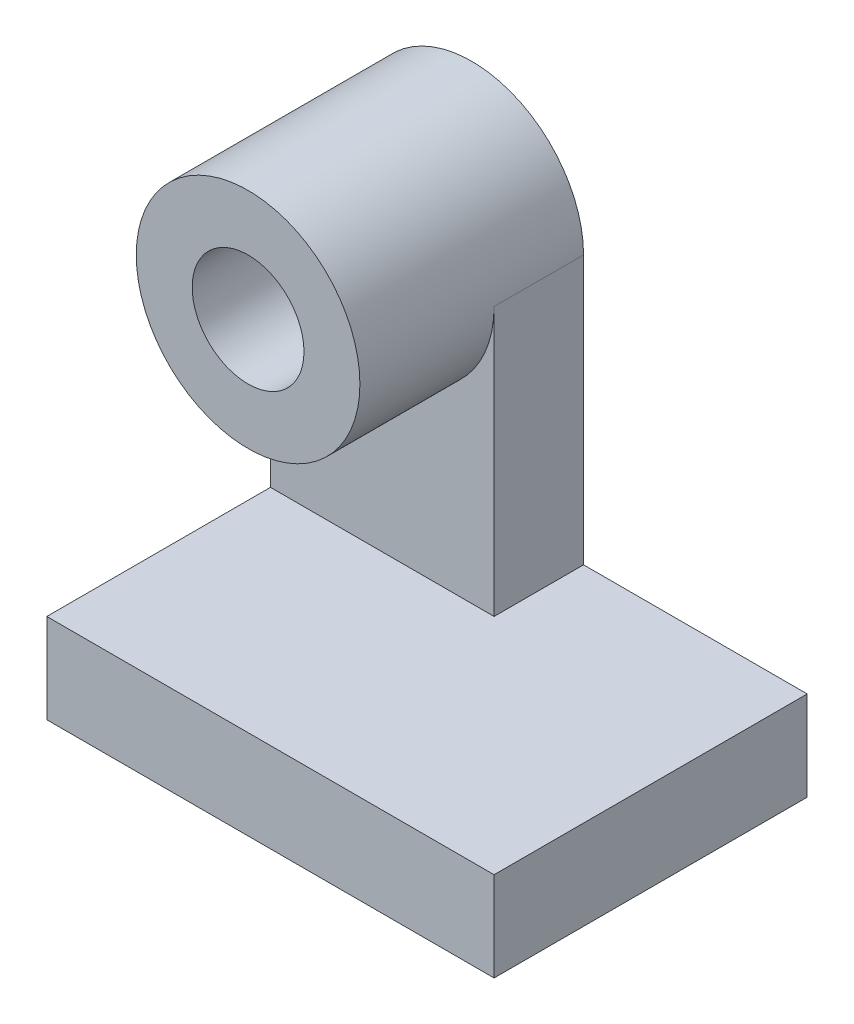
ISO-10303-21;
HEADER;
FILE_DESCRIPTION(('STEP AP214'),'2;1');
FILE_NAME('part.step','',(''),(''),'','','');
FILE_SCHEMA(('AUTOMOTIVE_DESIGN { 1 0 10303 214 1 1 1 1 }'));
ENDSEC;
DATA;
#1=APPLICATION_CONTEXT('core data for automotive mechanical design processes');
#2=APPLICATION_PROTOCOL_DEFINITION('international standard','automotive_design',2000,#1);
#3=PRODUCT_CONTEXT('',#1,'mechanical');
#4=PRODUCT('Part','Part','',(#3));
#5=PRODUCT_RELATED_PRODUCT_CATEGORY('part','',(#4));
#6=PRODUCT_DEFINITION_FORMATION('','',#4);
#7=PRODUCT_DEFINITION_CONTEXT('part definition',#1,'design');
#8=PRODUCT_DEFINITION('design','',#6,#7);
#9=PRODUCT_DEFINITION_SHAPE('','',#8);
#10=(LENGTH_UNIT() NAMED_UNIT(*) SI_UNIT(.MILLI.,.METRE.));
#11=(NAMED_UNIT(*) PLANE_ANGLE_UNIT() SI_UNIT($,.RADIAN.));
#12=(NAMED_UNIT(*) SI_UNIT($,.STERADIAN.) SOLID_ANGLE_UNIT());
#13=UNCERTAINTY_MEASURE_WITH_UNIT(LENGTH_MEASURE(1.E-05),#10,'distance_accuracy_value','');
#14=(GEOMETRIC_REPRESENTATION_CONTEXT(3) GLOBAL_UNCERTAINTY_ASSIGNED_CONTEXT((#13)) GLOBAL_UNIT_ASSIGNED_CONTEXT((#10,
#11,#12)) REPRESENTATION_CONTEXT('',''));
#15=CARTESIAN_POINT('',(0.,0.,0.));
#16=DIRECTION('',(0.,0.,1.));
#17=DIRECTION('',(1.,0.,0.));
#18=AXIS2_PLACEMENT_3D('',#15,#16,#17);
#19=CARTESIAN_POINT('',(0.,0.,88.9));
#20=DIRECTION('',(-1.,0.,0.));
#21=DIRECTION('',(0.,0.,1.));
#22=AXIS2_PLACEMENT_3D('',#19,#20,#21);
#23=PLANE('',#22);
#24=DIRECTION('',(0.,1.,0.));
#25=VECTOR('',#24,1.);
#26=CARTESIAN_POINT('',(0.,0.,0.));
#27=LINE('',#26,#25);
#28=CARTESIAN_POINT('',(0.,0.,0.));
#29=VERTEX_POINT('',#28);
#30=CARTESIAN_POINT('',(0.,101.6,0.));
#31=VERTEX_POINT('',#30);
#32=EDGE_CURVE('E150',#29,#31,#27,.T.);
#33=ORIENTED_EDGE('',*,*,#32,.F.);
#34=DIRECTION('',(0.,0.,-1.));
#35=VECTOR('',#34,1.);
#36=CARTESIAN_POINT('',(0.,0.,88.9));
#37=LINE('',#36,#35);
#38=CARTESIAN_POINT('',(0.,0.,88.9));
#39=VERTEX_POINT('',#38);
#40=EDGE_CURVE('E11',#39,#29,#37,.T.);
#41=ORIENTED_EDGE('',*,*,#40,.F.);
#42=DIRECTION('',(0.,1.,0.));
#43=VECTOR('',#42,1.);
#44=CARTESIAN_POINT('',(0.,0.,88.9));
#45=LINE('',#44,#43);
#46=CARTESIAN_POINT('',(0.,25.4,88.9));
#47=VERTEX_POINT('',#46);
#48=EDGE_CURVE('E145',#39,#47,#45,.T.);
#49=ORIENTED_EDGE('',*,*,#48,.T.);
#50=DIRECTION('',(0.,0.,-1.));
#51=VECTOR('',#50,1.);
#52=CARTESIAN_POINT('',(0.,25.4,88.9));
#53=LINE('',#52,#51);
#54=CARTESIAN_POINT('',(0.,25.4,25.4));
#55=VERTEX_POINT('',#54);
#56=EDGE_CURVE('E132',#47,#55,#53,.T.);
#57=ORIENTED_EDGE('',*,*,#56,.T.);
#58=DIRECTION('',(0.,1.,0.));
#59=VECTOR('',#58,1.);
#60=CARTESIAN_POINT('',(0.,0.,25.4));
#61=LINE('',#60,#59);
#62=CARTESIAN_POINT('',(0.,101.6,25.4));
#63=VERTEX_POINT('',#62);
#64=EDGE_CURVE('E114',#55,#63,#61,.T.);
#65=ORIENTED_EDGE('',*,*,#64,.T.);
#66=DIRECTION('',(0.,0.,-1.));
#67=VECTOR('',#66,1.);
#68=CARTESIAN_POINT('',(0.,101.6,25.4));
#69=LINE('',#68,#67);
#70=EDGE_CURVE('E113',#63,#31,#69,.T.);
#71=ORIENTED_EDGE('',*,*,#70,.T.);
#72=EDGE_LOOP('',(#33,#41,#49,#57,#65,#71));
#73=FACE_BOUND('',#72,.T.);
#74=ADVANCED_FACE('F34',(#73),#23,.T.);
#75=CARTESIAN_POINT('',(0.,0.,88.9));
#76=DIRECTION('',(0.,1.,0.));
#77=DIRECTION('',(0.,0.,1.));
#78=AXIS2_PLACEMENT_3D('',#75,#76,#77);
#79=PLANE('',#78);
#80=DIRECTION('',(1.,0.,0.));
#81=VECTOR('',#80,1.);
#82=CARTESIAN_POINT('',(0.,0.,0.));
#83=LINE('',#82,#81);
#84=CARTESIAN_POINT('',(127.,0.,0.));
#85=VERTEX_POINT('',#84);
#86=EDGE_CURVE('E143',#29,#85,#83,.T.);
#87=ORIENTED_EDGE('',*,*,#86,.T.);
#88=DIRECTION('',(0.,0.,-1.));
#89=VECTOR('',#88,1.);
#90=CARTESIAN_POINT('',(127.,0.,88.9));
#91=LINE('',#90,#89);
#92=CARTESIAN_POINT('',(127.,0.,88.9));
#93=VERTEX_POINT('',#92);
#94=EDGE_CURVE('E42',#93,#85,#91,.T.);
#95=ORIENTED_EDGE('',*,*,#94,.F.);
#96=DIRECTION('',(1.,0.,0.));
#97=VECTOR('',#96,1.);
#98=CARTESIAN_POINT('',(0.,0.,88.9));
#99=LINE('',#98,#97);
#100=EDGE_CURVE('E136',#39,#93,#99,.T.);
#101=ORIENTED_EDGE('',*,*,#100,.F.);
#102=ORIENTED_EDGE('',*,*,#40,.T.);
#103=EDGE_LOOP('',(#87,#95,#101,#102));
#104=FACE_BOUND('',#103,.T.);
#105=ADVANCED_FACE('F199',(#104),#79,.F.);
#106=CARTESIAN_POINT('',(127.,0.,88.9));
#107=DIRECTION('',(-1.,0.,0.));
#108=DIRECTION('',(0.,0.,1.));
#109=AXIS2_PLACEMENT_3D('',#106,#107,#108);
#110=PLANE('',#109);
#111=DIRECTION('',(0.,1.,0.));
#112=VECTOR('',#111,1.);
#113=CARTESIAN_POINT('',(127.,0.,0.));
#114=LINE('',#113,#112);
#115=CARTESIAN_POINT('',(127.,25.4,0.));
#116=VERTEX_POINT('',#115);
#117=EDGE_CURVE('E146',#85,#116,#114,.T.);
#118=ORIENTED_EDGE('',*,*,#117,.T.);
#119=DIRECTION('',(0.,0.,-1.));
#120=VECTOR('',#119,1.);
#121=CARTESIAN_POINT('',(127.,25.4,88.9));
#122=LINE('',#121,#120);
#123=CARTESIAN_POINT('',(127.,25.4,88.9));
#124=VERTEX_POINT('',#123);
#125=EDGE_CURVE('E135',#124,#116,#122,.T.);
#126=ORIENTED_EDGE('',*,*,#125,.F.);
#127=DIRECTION('',(0.,1.,0.));
#128=VECTOR('',#127,1.);
#129=CARTESIAN_POINT('',(127.,0.,88.9));
#130=LINE('',#129,#128);
#131=EDGE_CURVE('E153',#93,#124,#130,.T.);
#132=ORIENTED_EDGE('',*,*,#131,.F.);
#133=ORIENTED_EDGE('',*,*,#94,.T.);
#134=EDGE_LOOP('',(#118,#126,#132,#133));
#135=FACE_BOUND('',#134,.T.);
#136=ADVANCED_FACE('F171',(#135),#110,.F.);
#137=CARTESIAN_POINT('',(0.,25.4,88.9));
#138=DIRECTION('',(0.,1.,0.));
#139=DIRECTION('',(0.,0.,1.));
#140=AXIS2_PLACEMENT_3D('',#137,#138,#139);
#141=PLANE('',#140);
#142=DIRECTION('',(0.,0.,-1.));
#143=VECTOR('',#142,1.);
#144=CARTESIAN_POINT('',(63.5,25.4,25.4));
#145=LINE('',#144,#143);
#146=CARTESIAN_POINT('',(63.5,25.4,25.4));
#147=VERTEX_POINT('',#146);
#148=CARTESIAN_POINT('',(63.5,25.4,0.));
#149=VERTEX_POINT('',#148);
#150=EDGE_CURVE('E102',#147,#149,#145,.T.);
#151=ORIENTED_EDGE('',*,*,#150,.F.);
#152=DIRECTION('',(1.,0.,0.));
#153=VECTOR('',#152,1.);
#154=CARTESIAN_POINT('',(0.,25.4,25.4));
#155=LINE('',#154,#153);
#156=EDGE_CURVE('E50',#55,#147,#155,.T.);
#157=ORIENTED_EDGE('',*,*,#156,.F.);
#158=ORIENTED_EDGE('',*,*,#56,.F.);
#159=DIRECTION('',(1.,0.,0.));
#160=VECTOR('',#159,1.);
#161=CARTESIAN_POINT('',(0.,25.4,88.9));
#162=LINE('',#161,#160);
#163=EDGE_CURVE('E155',#47,#124,#162,.T.);
#164=ORIENTED_EDGE('',*,*,#163,.T.);
#165=ORIENTED_EDGE('',*,*,#125,.T.);
#166=DIRECTION('',(1.,0.,0.));
#167=VECTOR('',#166,1.);
#168=CARTESIAN_POINT('',(0.,25.4,0.));
#169=LINE('',#168,#167);
#170=EDGE_CURVE('E56',#149,#116,#169,.T.);
#171=ORIENTED_EDGE('',*,*,#170,.F.);
#172=EDGE_LOOP('',(#151,#157,#158,#164,#165,#171));
#173=FACE_BOUND('',#172,.T.);
#174=ADVANCED_FACE('F168',(#173),#141,.T.);
#175=CARTESIAN_POINT('',(0.,0.,88.9));
#176=DIRECTION('',(0.,0.,-1.));
#177=DIRECTION('',(-1.,0.,0.));
#178=AXIS2_PLACEMENT_3D('',#175,#176,#177);
#179=PLANE('',#178);
#180=ORIENTED_EDGE('',*,*,#48,.F.);
#181=ORIENTED_EDGE('',*,*,#100,.T.);
#182=ORIENTED_EDGE('',*,*,#131,.T.);
#183=ORIENTED_EDGE('',*,*,#163,.F.);
#184=EDGE_LOOP('',(#180,#181,#182,#183));
#185=FACE_BOUND('',#184,.T.);
#186=ADVANCED_FACE('F164',(#185),#179,.F.);
#187=CARTESIAN_POINT('',(0.,0.,0.));
#188=DIRECTION('',(0.,0.,-1.));
#189=DIRECTION('',(-1.,0.,0.));
#190=AXIS2_PLACEMENT_3D('',#187,#188,#189);
#191=PLANE('',#190);
#192=ORIENTED_EDGE('',*,*,#32,.T.);
#193=CARTESIAN_POINT('',(31.75,101.6,0.));
#194=DIRECTION('',(0.,0.,1.));
#195=DIRECTION('',(1.,0.,0.));
#196=AXIS2_PLACEMENT_3D('',#193,#194,#195);
#197=CIRCLE('',#196,31.75);
#198=CARTESIAN_POINT('',(63.5,101.6,0.));
#199=VERTEX_POINT('',#198);
#200=EDGE_CURVE('E176',#199,#31,#197,.T.);
#201=ORIENTED_EDGE('',*,*,#200,.F.);
#202=DIRECTION('',(0.,1.,0.));
#203=VECTOR('',#202,1.);
#204=CARTESIAN_POINT('',(63.5,0.,0.));
#205=LINE('',#204,#203);
#206=EDGE_CURVE('E97',#149,#199,#205,.T.);
#207=ORIENTED_EDGE('',*,*,#206,.F.);
#208=ORIENTED_EDGE('',*,*,#170,.T.);
#209=ORIENTED_EDGE('',*,*,#117,.F.);
#210=ORIENTED_EDGE('',*,*,#86,.F.);
#211=EDGE_LOOP('',(#192,#201,#207,#208,#209,#210));
#212=FACE_BOUND('',#211,.T.);
#213=CARTESIAN_POINT('',(31.75,101.6,0.));
#214=DIRECTION('',(0.,0.,1.));
#215=DIRECTION('',(1.,0.,0.));
#216=AXIS2_PLACEMENT_3D('',#213,#214,#215);
#217=CIRCLE('',#216,15.875);
#218=CARTESIAN_POINT('',(47.625,101.6,0.));
#219=VERTEX_POINT('',#218);
#220=EDGE_CURVE('E119',#219,#219,#217,.T.);
#221=ORIENTED_EDGE('',*,*,#220,.T.);
#222=EDGE_LOOP('',(#221));
#223=FACE_BOUND('',#222,.T.);
#224=ADVANCED_FACE('F174',(#212,#223),#191,.T.);
#225=CARTESIAN_POINT('',(63.5,0.,25.4));
#226=DIRECTION('',(-1.,0.,0.));
#227=DIRECTION('',(0.,0.,1.));
#228=AXIS2_PLACEMENT_3D('',#225,#226,#227);
#229=PLANE('',#228);
#230=ORIENTED_EDGE('',*,*,#206,.T.);
#231=DIRECTION('',(0.,0.,-1.));
#232=VECTOR('',#231,1.);
#233=CARTESIAN_POINT('',(63.5,101.6,25.4));
#234=LINE('',#233,#232);
#235=CARTESIAN_POINT('',(63.5,101.6,25.4));
#236=VERTEX_POINT('',#235);
#237=EDGE_CURVE('E92',#236,#199,#234,.T.);
#238=ORIENTED_EDGE('',*,*,#237,.F.);
#239=DIRECTION('',(0.,1.,0.));
#240=VECTOR('',#239,1.);
#241=CARTESIAN_POINT('',(63.5,0.,25.4));
#242=LINE('',#241,#240);
#243=EDGE_CURVE('E95',#147,#236,#242,.T.);
#244=ORIENTED_EDGE('',*,*,#243,.F.);
#245=ORIENTED_EDGE('',*,*,#150,.T.);
#246=EDGE_LOOP('',(#230,#238,#244,#245));
#247=FACE_BOUND('',#246,.T.);
#248=ADVANCED_FACE('F94',(#247),#229,.F.);
#249=CARTESIAN_POINT('',(0.,0.,25.4));
#250=DIRECTION('',(0.,0.,1.));
#251=DIRECTION('',(1.,0.,0.));
#252=AXIS2_PLACEMENT_3D('',#249,#250,#251);
#253=PLANE('',#252);
#254=CARTESIAN_POINT('',(31.75,101.6,25.4));
#255=DIRECTION('',(0.,0.,1.));
#256=DIRECTION('',(1.,0.,0.));
#257=AXIS2_PLACEMENT_3D('',#254,#255,#256);
#258=CIRCLE('',#257,31.75);
#259=EDGE_CURVE('E107',#63,#236,#258,.T.);
#260=ORIENTED_EDGE('',*,*,#259,.F.);
#261=ORIENTED_EDGE('',*,*,#64,.F.);
#262=ORIENTED_EDGE('',*,*,#156,.T.);
#263=ORIENTED_EDGE('',*,*,#243,.T.);
#264=EDGE_LOOP('',(#260,#261,#262,#263));
#265=FACE_BOUND('',#264,.T.);
#266=ADVANCED_FACE('F105',(#265),#253,.T.);
#267=CARTESIAN_POINT('',(31.75,101.6,63.5));
#268=DIRECTION('',(0.,0.,-1.));
#269=DIRECTION('',(-1.,0.,0.));
#270=AXIS2_PLACEMENT_3D('',#267,#268,#269);
#271=CYLINDRICAL_SURFACE('',#270,31.75);
#272=CARTESIAN_POINT('',(31.75,101.6,63.5));
#273=DIRECTION('',(0.,0.,1.));
#274=DIRECTION('',(1.,0.,0.));
#275=AXIS2_PLACEMENT_3D('',#272,#273,#274);
#276=CIRCLE('',#275,31.75);
#277=CARTESIAN_POINT('',(63.5,101.6,63.5));
#278=VERTEX_POINT('',#277);
#279=EDGE_CURVE('E178',#278,#278,#276,.T.);
#280=ORIENTED_EDGE('',*,*,#279,.F.);
#281=EDGE_LOOP('',(#280));
#282=FACE_BOUND('',#281,.T.);
#283=ORIENTED_EDGE('',*,*,#200,.T.);
#284=ORIENTED_EDGE('',*,*,#70,.F.);
#285=ORIENTED_EDGE('',*,*,#259,.T.);
#286=ORIENTED_EDGE('',*,*,#237,.T.);
#287=EDGE_LOOP('',(#283,#284,#285,#286));
#288=FACE_BOUND('',#287,.T.);
#289=ADVANCED_FACE('F111',(#282,#288),#271,.T.);
#290=CARTESIAN_POINT('',(31.75,101.6,63.5));
#291=DIRECTION('',(0.,0.,-1.));
#292=DIRECTION('',(-1.,0.,0.));
#293=AXIS2_PLACEMENT_3D('',#290,#291,#292);
#294=CYLINDRICAL_SURFACE('',#293,15.875);
#295=CARTESIAN_POINT('',(31.75,101.6,63.5));
#296=DIRECTION('',(0.,0.,1.));
#297=DIRECTION('',(1.,0.,0.));
#298=AXIS2_PLACEMENT_3D('',#295,#296,#297);
#299=CIRCLE('',#298,15.875);
#300=CARTESIAN_POINT('',(47.625,101.6,63.5));
#301=VERTEX_POINT('',#300);
#302=EDGE_CURVE('E117',#301,#301,#299,.T.);
#303=ORIENTED_EDGE('',*,*,#302,.T.);
#304=EDGE_LOOP('',(#303));
#305=FACE_BOUND('',#304,.T.);
#306=ORIENTED_EDGE('',*,*,#220,.F.);
#307=EDGE_LOOP('',(#306));
#308=FACE_BOUND('',#307,.T.);
#309=ADVANCED_FACE('F189',(#305,#308),#294,.F.);
#310=CARTESIAN_POINT('',(0.,0.,63.5));
#311=DIRECTION('',(0.,0.,1.));
#312=DIRECTION('',(1.,0.,0.));
#313=AXIS2_PLACEMENT_3D('',#310,#311,#312);
#314=PLANE('',#313);
#315=ORIENTED_EDGE('',*,*,#279,.T.);
#316=EDGE_LOOP('',(#315));
#317=FACE_BOUND('',#316,.T.);
#318=ORIENTED_EDGE('',*,*,#302,.F.);
#319=EDGE_LOOP('',(#318));
#320=FACE_BOUND('',#319,.T.);
#321=ADVANCED_FACE('F185',(#317,#320),#314,.T.);
#322=CLOSED_SHELL('',(#74,#105,#136,#174,#186,#224,#248,#266,#289,#309,#321));
#323=MANIFOLD_SOLID_BREP('B2',#322);
#324=ADVANCED_BREP_SHAPE_REPRESENTATION('',(#18,#323),#14);
#325=SHAPE_DEFINITION_REPRESENTATION(#9,#324);
ENDSEC;
END-ISO-10303-21;
